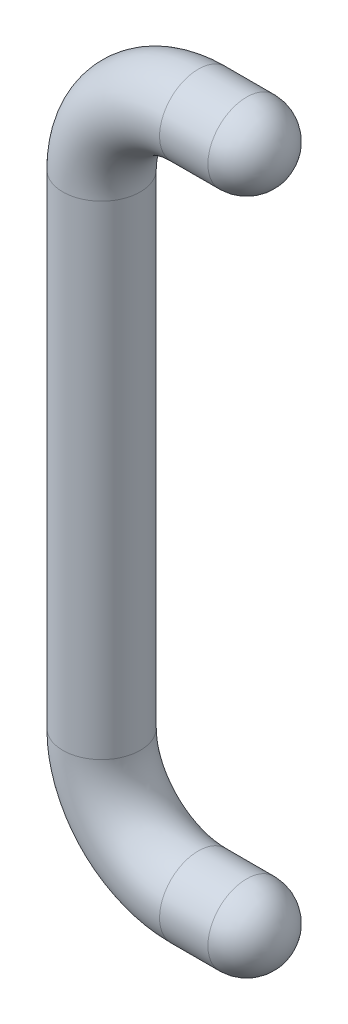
ISO-10303-21;
HEADER;
FILE_DESCRIPTION(('STEP AP214'),'2;1');
FILE_NAME('part.step','',(''),(''),'','','');
FILE_SCHEMA(('AUTOMOTIVE_DESIGN { 1 0 10303 214 1 1 1 1 }'));
ENDSEC;
DATA;
#1=APPLICATION_CONTEXT('core data for automotive mechanical design processes');
#2=APPLICATION_PROTOCOL_DEFINITION('international standard','automotive_design',2000,#1);
#3=PRODUCT_CONTEXT('',#1,'mechanical');
#4=PRODUCT('Part','Part','',(#3));
#5=PRODUCT_RELATED_PRODUCT_CATEGORY('part','',(#4));
#6=PRODUCT_DEFINITION_FORMATION('','',#4);
#7=PRODUCT_DEFINITION_CONTEXT('part definition',#1,'design');
#8=PRODUCT_DEFINITION('design','',#6,#7);
#9=PRODUCT_DEFINITION_SHAPE('','',#8);
#10=(LENGTH_UNIT() NAMED_UNIT(*) SI_UNIT(.MILLI.,.METRE.));
#11=(NAMED_UNIT(*) PLANE_ANGLE_UNIT() SI_UNIT($,.RADIAN.));
#12=(NAMED_UNIT(*) SI_UNIT($,.STERADIAN.) SOLID_ANGLE_UNIT());
#13=UNCERTAINTY_MEASURE_WITH_UNIT(LENGTH_MEASURE(1.E-05),#10,'distance_accuracy_value','');
#14=(GEOMETRIC_REPRESENTATION_CONTEXT(3) GLOBAL_UNCERTAINTY_ASSIGNED_CONTEXT((#13)) GLOBAL_UNIT_ASSIGNED_CONTEXT((#10,
#11,#12)) REPRESENTATION_CONTEXT('',''));
#15=CARTESIAN_POINT('',(0.,0.,0.));
#16=DIRECTION('',(0.,0.,1.));
#17=DIRECTION('',(1.,0.,0.));
#18=AXIS2_PLACEMENT_3D('',#15,#16,#17);
#19=CARTESIAN_POINT('',(20.,15.,0.));
#20=DIRECTION('',(1.,0.,0.));
#21=DIRECTION('',(0.,0.,-1.));
#22=AXIS2_PLACEMENT_3D('',#19,#20,#21);
#23=CYLINDRICAL_SURFACE('',#22,2.);
#24=CARTESIAN_POINT('',(22.5,15.,0.));
#25=DIRECTION('',(1.,0.,0.));
#26=DIRECTION('',(0.,1.,0.));
#27=AXIS2_PLACEMENT_3D('',#24,#25,#26);
#28=CIRCLE('',#27,2.);
#29=CARTESIAN_POINT('',(22.5,15.,-2.));
#30=VERTEX_POINT('',#29);
#31=CARTESIAN_POINT('',(22.5,15.,2.));
#32=VERTEX_POINT('',#31);
#33=EDGE_CURVE('E59',#30,#32,#28,.T.);
#34=ORIENTED_EDGE('',*,*,#33,.F.);
#35=CARTESIAN_POINT('',(22.5,15.,0.));
#36=DIRECTION('',(-1.,0.,0.));
#37=DIRECTION('',(0.,-1.,0.));
#38=AXIS2_PLACEMENT_3D('',#35,#36,#37);
#39=CIRCLE('',#38,2.);
#40=EDGE_CURVE('E37',#30,#32,#39,.T.);
#41=ORIENTED_EDGE('',*,*,#40,.T.);
#42=EDGE_LOOP('',(#34,#41));
#43=FACE_BOUND('',#42,.T.);
#44=CARTESIAN_POINT('',(20.,15.,0.));
#45=DIRECTION('',(-1.,0.,0.));
#46=DIRECTION('',(0.,-1.,0.));
#47=AXIS2_PLACEMENT_3D('',#44,#45,#46);
#48=CIRCLE('',#47,2.);
#49=CARTESIAN_POINT('',(20.,13.,0.));
#50=VERTEX_POINT('',#49);
#51=EDGE_CURVE('E11',#50,#50,#48,.T.);
#52=ORIENTED_EDGE('',*,*,#51,.F.);
#53=EDGE_LOOP('',(#52));
#54=FACE_BOUND('',#53,.T.);
#55=ADVANCED_FACE('F16',(#43,#54),#23,.T.);
#56=CARTESIAN_POINT('',(20.,20.,0.));
#57=DIRECTION('',(0.,0.,-1.));
#58=DIRECTION('',(1.,0.,0.));
#59=AXIS2_PLACEMENT_3D('',#56,#57,#58);
#60=TOROIDAL_SURFACE('',#59,5.,2.);
#61=CARTESIAN_POINT('',(15.,20.,0.));
#62=DIRECTION('',(0.,1.,0.));
#63=DIRECTION('',(1.,0.,0.));
#64=AXIS2_PLACEMENT_3D('',#61,#62,#63);
#65=CIRCLE('',#64,2.);
#66=CARTESIAN_POINT('',(13.,20.,0.));
#67=VERTEX_POINT('',#66);
#68=EDGE_CURVE('E24',#67,#67,#65,.T.);
#69=CARTESIAN_POINT('',(20.,20.,0.));
#70=DIRECTION('',(0.,0.,-1.));
#71=DIRECTION('',(1.,0.,0.));
#72=AXIS2_PLACEMENT_3D('',#69,#70,#71);
#73=CIRCLE('',#72,7.);
#74=EDGE_CURVE('',#50,#67,#73,.T.);
#75=ORIENTED_EDGE('',*,*,#51,.T.);
#76=ORIENTED_EDGE('',*,*,#68,.F.);
#77=ORIENTED_EDGE('',*,*,#74,.T.);
#78=ORIENTED_EDGE('',*,*,#74,.F.);
#79=EDGE_LOOP('',(#75,#77,#76,#78));
#80=FACE_BOUND('',#79,.T.);
#81=ADVANCED_FACE('F83',(#80),#60,.T.);
#82=CARTESIAN_POINT('',(15.,45.,0.));
#83=DIRECTION('',(0.,-1.,0.));
#84=DIRECTION('',(0.,0.,-1.));
#85=AXIS2_PLACEMENT_3D('',#82,#83,#84);
#86=CYLINDRICAL_SURFACE('',#85,2.);
#87=ORIENTED_EDGE('',*,*,#68,.T.);
#88=EDGE_LOOP('',(#87));
#89=FACE_BOUND('',#88,.T.);
#90=CARTESIAN_POINT('',(15.,45.,0.));
#91=DIRECTION('',(0.,1.,0.));
#92=DIRECTION('',(1.,0.,0.));
#93=AXIS2_PLACEMENT_3D('',#90,#91,#92);
#94=CIRCLE('',#93,2.);
#95=CARTESIAN_POINT('',(13.,45.,0.));
#96=VERTEX_POINT('',#95);
#97=EDGE_CURVE('E67',#96,#96,#94,.T.);
#98=ORIENTED_EDGE('',*,*,#97,.F.);
#99=EDGE_LOOP('',(#98));
#100=FACE_BOUND('',#99,.T.);
#101=ADVANCED_FACE('F80',(#89,#100),#86,.T.);
#102=CARTESIAN_POINT('',(20.,45.,0.));
#103=DIRECTION('',(0.,0.,-1.));
#104=DIRECTION('',(1.,0.,0.));
#105=AXIS2_PLACEMENT_3D('',#102,#103,#104);
#106=TOROIDAL_SURFACE('',#105,5.,2.);
#107=CARTESIAN_POINT('',(20.,50.,0.));
#108=DIRECTION('',(1.,0.,0.));
#109=DIRECTION('',(0.,-1.,0.));
#110=AXIS2_PLACEMENT_3D('',#107,#108,#109);
#111=CIRCLE('',#110,2.);
#112=CARTESIAN_POINT('',(20.,52.,0.));
#113=VERTEX_POINT('',#112);
#114=EDGE_CURVE('E64',#113,#113,#111,.T.);
#115=CARTESIAN_POINT('',(20.,45.,0.));
#116=DIRECTION('',(0.,0.,-1.));
#117=DIRECTION('',(1.,0.,0.));
#118=AXIS2_PLACEMENT_3D('',#115,#116,#117);
#119=CIRCLE('',#118,7.);
#120=EDGE_CURVE('',#96,#113,#119,.T.);
#121=ORIENTED_EDGE('',*,*,#97,.T.);
#122=ORIENTED_EDGE('',*,*,#114,.F.);
#123=ORIENTED_EDGE('',*,*,#120,.T.);
#124=ORIENTED_EDGE('',*,*,#120,.F.);
#125=EDGE_LOOP('',(#121,#123,#122,#124));
#126=FACE_BOUND('',#125,.T.);
#127=ADVANCED_FACE('F91',(#126),#106,.T.);
#128=CARTESIAN_POINT('',(22.5,50.,0.));
#129=DIRECTION('',(-1.,0.,0.));
#130=DIRECTION('',(0.,0.,-1.));
#131=AXIS2_PLACEMENT_3D('',#128,#129,#130);
#132=CYLINDRICAL_SURFACE('',#131,2.);
#133=ORIENTED_EDGE('',*,*,#114,.T.);
#134=EDGE_LOOP('',(#133));
#135=FACE_BOUND('',#134,.T.);
#136=CARTESIAN_POINT('',(22.5,50.,0.));
#137=DIRECTION('',(1.,0.,0.));
#138=DIRECTION('',(0.,1.,0.));
#139=AXIS2_PLACEMENT_3D('',#136,#137,#138);
#140=CIRCLE('',#139,2.);
#141=CARTESIAN_POINT('',(22.5,50.,-2.));
#142=VERTEX_POINT('',#141);
#143=CARTESIAN_POINT('',(22.5,50.,2.));
#144=VERTEX_POINT('',#143);
#145=EDGE_CURVE('E44',#142,#144,#140,.T.);
#146=ORIENTED_EDGE('',*,*,#145,.F.);
#147=CARTESIAN_POINT('',(22.5,50.,0.));
#148=DIRECTION('',(-1.,0.,0.));
#149=DIRECTION('',(0.,-1.,0.));
#150=AXIS2_PLACEMENT_3D('',#147,#148,#149);
#151=CIRCLE('',#150,2.);
#152=EDGE_CURVE('E30',#142,#144,#151,.T.);
#153=ORIENTED_EDGE('',*,*,#152,.T.);
#154=EDGE_LOOP('',(#146,#153));
#155=FACE_BOUND('',#154,.T.);
#156=ADVANCED_FACE('F47',(#135,#155),#132,.T.);
#157=CARTESIAN_POINT('',(22.5,15.,0.));
#158=DIRECTION('',(0.,0.,1.));
#159=DIRECTION('',(0.,1.,0.));
#160=AXIS2_PLACEMENT_3D('',#157,#158,#159);
#161=SPHERICAL_SURFACE('',#160,2.);
#162=CARTESIAN_POINT('',(22.5,15.,0.));
#163=DIRECTION('',(1.,0.,0.));
#164=DIRECTION('',(0.,1.,0.));
#165=AXIS2_PLACEMENT_3D('',#162,#163,#164);
#166=SPHERICAL_SURFACE('',#165,2.);
#167=ORIENTED_EDGE('',*,*,#33,.T.);
#168=ORIENTED_EDGE('',*,*,#40,.F.);
#169=EDGE_LOOP('',(#167,#168));
#170=FACE_BOUND('',#169,.T.);
#171=ADVANCED_FACE('F99',(#170),#166,.T.);
#172=CARTESIAN_POINT('',(22.5,50.,0.));
#173=DIRECTION('',(0.,0.,1.));
#174=DIRECTION('',(0.,1.,0.));
#175=AXIS2_PLACEMENT_3D('',#172,#173,#174);
#176=SPHERICAL_SURFACE('',#175,2.);
#177=CARTESIAN_POINT('',(22.5,50.,0.));
#178=DIRECTION('',(1.,0.,0.));
#179=DIRECTION('',(0.,1.,0.));
#180=AXIS2_PLACEMENT_3D('',#177,#178,#179);
#181=SPHERICAL_SURFACE('',#180,2.);
#182=ORIENTED_EDGE('',*,*,#145,.T.);
#183=ORIENTED_EDGE('',*,*,#152,.F.);
#184=EDGE_LOOP('',(#182,#183));
#185=FACE_BOUND('',#184,.T.);
#186=ADVANCED_FACE('F43',(#185),#181,.T.);
#187=CLOSED_SHELL('',(#55,#81,#101,#127,#156,#171,#186));
#188=MANIFOLD_SOLID_BREP('B1',#187);
#189=ADVANCED_BREP_SHAPE_REPRESENTATION('',(#18,#188),#14);
#190=SHAPE_DEFINITION_REPRESENTATION(#9,#189);
ENDSEC;
END-ISO-10303-21;
